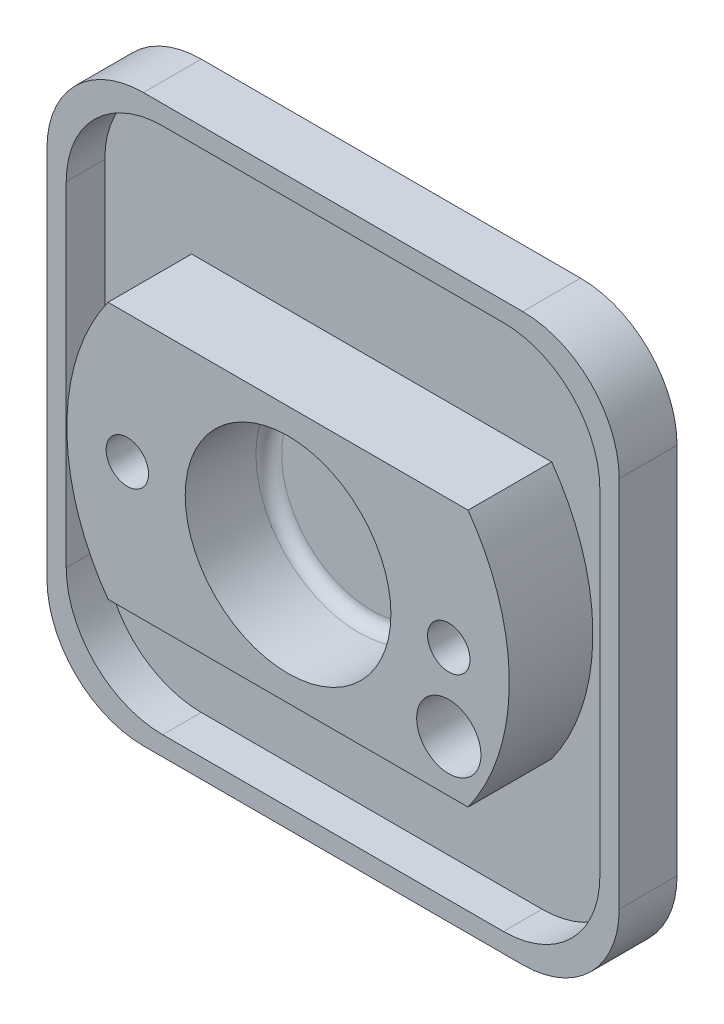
ISO-10303-21;
HEADER;
FILE_DESCRIPTION(('STEP AP214'),'2;1');
FILE_NAME('part.step','',(''),(''),'','','');
FILE_SCHEMA(('AUTOMOTIVE_DESIGN { 1 0 10303 214 1 1 1 1 }'));
ENDSEC;
DATA;
#1=APPLICATION_CONTEXT('core data for automotive mechanical design processes');
#2=APPLICATION_PROTOCOL_DEFINITION('international standard','automotive_design',2000,#1);
#3=PRODUCT_CONTEXT('',#1,'mechanical');
#4=PRODUCT('Part','Part','',(#3));
#5=PRODUCT_RELATED_PRODUCT_CATEGORY('part','',(#4));
#6=PRODUCT_DEFINITION_FORMATION('','',#4);
#7=PRODUCT_DEFINITION_CONTEXT('part definition',#1,'design');
#8=PRODUCT_DEFINITION('design','',#6,#7);
#9=PRODUCT_DEFINITION_SHAPE('','',#8);
#10=(LENGTH_UNIT() NAMED_UNIT(*) SI_UNIT(.MILLI.,.METRE.));
#11=(NAMED_UNIT(*) PLANE_ANGLE_UNIT() SI_UNIT($,.RADIAN.));
#12=(NAMED_UNIT(*) SI_UNIT($,.STERADIAN.) SOLID_ANGLE_UNIT());
#13=UNCERTAINTY_MEASURE_WITH_UNIT(LENGTH_MEASURE(1.E-05),#10,'distance_accuracy_value','');
#14=(GEOMETRIC_REPRESENTATION_CONTEXT(3) GLOBAL_UNCERTAINTY_ASSIGNED_CONTEXT((#13)) GLOBAL_UNIT_ASSIGNED_CONTEXT((#10,
#11,#12)) REPRESENTATION_CONTEXT('',''));
#15=CARTESIAN_POINT('',(0.,0.,0.));
#16=DIRECTION('',(0.,0.,1.));
#17=DIRECTION('',(1.,0.,0.));
#18=AXIS2_PLACEMENT_3D('',#15,#16,#17);
#19=CARTESIAN_POINT('',(-44.5,-44.,3.));
#20=DIRECTION('',(0.,0.,1.));
#21=DIRECTION('',(1.,0.,0.));
#22=AXIS2_PLACEMENT_3D('',#19,#20,#21);
#23=PLANE('',#22);
#24=DIRECTION('',(1.,0.,0.));
#25=VECTOR('',#24,1.);
#26=CARTESIAN_POINT('',(-44.5,-41.,3.));
#27=LINE('',#26,#25);
#28=CARTESIAN_POINT('',(-26.5,-41.,3.));
#29=VERTEX_POINT('',#28);
#30=CARTESIAN_POINT('',(26.5,-41.,3.));
#31=VERTEX_POINT('',#30);
#32=EDGE_CURVE('E201',#29,#31,#27,.T.);
#33=ORIENTED_EDGE('',*,*,#32,.T.);
#34=CARTESIAN_POINT('',(26.5,-26.,3.));
#35=DIRECTION('',(0.,0.,1.));
#36=DIRECTION('',(1.,0.,0.));
#37=AXIS2_PLACEMENT_3D('',#34,#35,#36);
#38=CIRCLE('',#37,15.);
#39=CARTESIAN_POINT('',(41.5,-26.,3.));
#40=VERTEX_POINT('',#39);
#41=EDGE_CURVE('E274',#31,#40,#38,.T.);
#42=ORIENTED_EDGE('',*,*,#41,.T.);
#43=DIRECTION('',(0.,1.,0.));
#44=VECTOR('',#43,1.);
#45=CARTESIAN_POINT('',(41.5,44.,3.));
#46=LINE('',#45,#44);
#47=CARTESIAN_POINT('',(41.5,26.,3.));
#48=VERTEX_POINT('',#47);
#49=EDGE_CURVE('E204',#40,#48,#46,.T.);
#50=ORIENTED_EDGE('',*,*,#49,.T.);
#51=CARTESIAN_POINT('',(26.5,26.,3.));
#52=DIRECTION('',(0.,0.,1.));
#53=DIRECTION('',(1.,0.,0.));
#54=AXIS2_PLACEMENT_3D('',#51,#52,#53);
#55=CIRCLE('',#54,15.);
#56=CARTESIAN_POINT('',(26.5,41.,3.));
#57=VERTEX_POINT('',#56);
#58=EDGE_CURVE('E255',#48,#57,#55,.T.);
#59=ORIENTED_EDGE('',*,*,#58,.T.);
#60=DIRECTION('',(-1.,0.,0.));
#61=VECTOR('',#60,1.);
#62=CARTESIAN_POINT('',(-44.5,41.,3.));
#63=LINE('',#62,#61);
#64=CARTESIAN_POINT('',(-26.5,41.,3.));
#65=VERTEX_POINT('',#64);
#66=EDGE_CURVE('E206',#57,#65,#63,.T.);
#67=ORIENTED_EDGE('',*,*,#66,.T.);
#68=CARTESIAN_POINT('',(-26.5,26.,3.));
#69=DIRECTION('',(0.,0.,1.));
#70=DIRECTION('',(1.,0.,0.));
#71=AXIS2_PLACEMENT_3D('',#68,#69,#70);
#72=CIRCLE('',#71,15.);
#73=CARTESIAN_POINT('',(-41.5,26.,3.));
#74=VERTEX_POINT('',#73);
#75=EDGE_CURVE('E245',#65,#74,#72,.T.);
#76=ORIENTED_EDGE('',*,*,#75,.T.);
#77=DIRECTION('',(0.,-1.,0.));
#78=VECTOR('',#77,1.);
#79=CARTESIAN_POINT('',(-41.5,44.,3.));
#80=LINE('',#79,#78);
#81=CARTESIAN_POINT('',(-41.5,-26.,3.));
#82=VERTEX_POINT('',#81);
#83=EDGE_CURVE('E166',#74,#82,#80,.T.);
#84=ORIENTED_EDGE('',*,*,#83,.T.);
#85=CARTESIAN_POINT('',(-26.5,-26.,3.));
#86=DIRECTION('',(0.,0.,1.));
#87=DIRECTION('',(1.,0.,0.));
#88=AXIS2_PLACEMENT_3D('',#85,#86,#87);
#89=CIRCLE('',#88,15.);
#90=EDGE_CURVE('E265',#82,#29,#89,.T.);
#91=ORIENTED_EDGE('',*,*,#90,.T.);
#92=EDGE_LOOP('',(#33,#42,#50,#59,#67,#76,#84,#91));
#93=FACE_BOUND('',#92,.T.);
#94=DIRECTION('',(-1.,0.,0.));
#95=VECTOR('',#94,1.);
#96=CARTESIAN_POINT('',(-28.,20.,3.));
#97=LINE('',#96,#95);
#98=CARTESIAN_POINT('',(28.,20.,3.));
#99=VERTEX_POINT('',#98);
#100=CARTESIAN_POINT('',(-28.,20.,3.));
#101=VERTEX_POINT('',#100);
#102=EDGE_CURVE('E160',#99,#101,#97,.T.);
#103=ORIENTED_EDGE('',*,*,#102,.F.);
#104=CARTESIAN_POINT('',(0.,0.,3.));
#105=DIRECTION('',(0.,0.,1.));
#106=DIRECTION('',(-1.,0.,0.));
#107=AXIS2_PLACEMENT_3D('',#104,#105,#106);
#108=CIRCLE('',#107,34.4093010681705);
#109=CARTESIAN_POINT('',(28.,-20.,3.));
#110=VERTEX_POINT('',#109);
#111=EDGE_CURVE('E171',#110,#99,#108,.T.);
#112=ORIENTED_EDGE('',*,*,#111,.F.);
#113=DIRECTION('',(1.,0.,0.));
#114=VECTOR('',#113,1.);
#115=CARTESIAN_POINT('',(-28.,-20.,3.));
#116=LINE('',#115,#114);
#117=CARTESIAN_POINT('',(-28.,-20.,3.));
#118=VERTEX_POINT('',#117);
#119=EDGE_CURVE('E183',#118,#110,#116,.T.);
#120=ORIENTED_EDGE('',*,*,#119,.F.);
#121=CARTESIAN_POINT('',(0.,0.,3.));
#122=DIRECTION('',(0.,0.,1.));
#123=DIRECTION('',(1.,0.,0.));
#124=AXIS2_PLACEMENT_3D('',#121,#122,#123);
#125=CIRCLE('',#124,34.4093010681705);
#126=EDGE_CURVE('E181',#101,#118,#125,.T.);
#127=ORIENTED_EDGE('',*,*,#126,.F.);
#128=EDGE_LOOP('',(#103,#112,#120,#127));
#129=FACE_BOUND('',#128,.T.);
#130=ADVANCED_FACE('F17',(#93,#129),#23,.T.);
#131=CARTESIAN_POINT('',(-44.5,44.,9.));
#132=DIRECTION('',(1.,0.,0.));
#133=DIRECTION('',(0.,1.,0.));
#134=AXIS2_PLACEMENT_3D('',#131,#132,#133);
#135=PLANE('',#134);
#136=DIRECTION('',(0.,-1.,0.));
#137=VECTOR('',#136,1.);
#138=CARTESIAN_POINT('',(-44.5,44.,0.));
#139=LINE('',#138,#137);
#140=CARTESIAN_POINT('',(-44.5,29.,0.));
#141=VERTEX_POINT('',#140);
#142=CARTESIAN_POINT('',(-44.5,-29.,0.));
#143=VERTEX_POINT('',#142);
#144=EDGE_CURVE('E218',#141,#143,#139,.T.);
#145=ORIENTED_EDGE('',*,*,#144,.T.);
#146=DIRECTION('',(0.,0.,-1.));
#147=VECTOR('',#146,1.);
#148=CARTESIAN_POINT('',(-44.5,-29.,9.));
#149=LINE('',#148,#147);
#150=CARTESIAN_POINT('',(-44.5,-29.,9.));
#151=VERTEX_POINT('',#150);
#152=EDGE_CURVE('E32',#143,#151,#149,.F.);
#153=ORIENTED_EDGE('',*,*,#152,.T.);
#154=DIRECTION('',(0.,-1.,0.));
#155=VECTOR('',#154,1.);
#156=CARTESIAN_POINT('',(-44.5,44.,9.));
#157=LINE('',#156,#155);
#158=CARTESIAN_POINT('',(-44.5,29.,9.));
#159=VERTEX_POINT('',#158);
#160=EDGE_CURVE('E227',#159,#151,#157,.T.);
#161=ORIENTED_EDGE('',*,*,#160,.F.);
#162=DIRECTION('',(0.,0.,-1.));
#163=VECTOR('',#162,1.);
#164=CARTESIAN_POINT('',(-44.5,29.,9.));
#165=LINE('',#164,#163);
#166=EDGE_CURVE('E302',#159,#141,#165,.T.);
#167=ORIENTED_EDGE('',*,*,#166,.T.);
#168=EDGE_LOOP('',(#145,#153,#161,#167));
#169=FACE_BOUND('',#168,.T.);
#170=ADVANCED_FACE('F19',(#169),#135,.F.);
#171=CARTESIAN_POINT('',(-44.5,-44.,9.));
#172=DIRECTION('',(0.,1.,0.));
#173=DIRECTION('',(0.,0.,1.));
#174=AXIS2_PLACEMENT_3D('',#171,#172,#173);
#175=PLANE('',#174);
#176=DIRECTION('',(1.,0.,0.));
#177=VECTOR('',#176,1.);
#178=CARTESIAN_POINT('',(-44.5,-44.,9.));
#179=LINE('',#178,#177);
#180=CARTESIAN_POINT('',(-29.5,-44.,9.));
#181=VERTEX_POINT('',#180);
#182=CARTESIAN_POINT('',(29.5,-44.,9.));
#183=VERTEX_POINT('',#182);
#184=EDGE_CURVE('E229',#181,#183,#179,.T.);
#185=ORIENTED_EDGE('',*,*,#184,.F.);
#186=DIRECTION('',(0.,0.,-1.));
#187=VECTOR('',#186,1.);
#188=CARTESIAN_POINT('',(-29.5,-44.,9.));
#189=LINE('',#188,#187);
#190=CARTESIAN_POINT('',(-29.5,-44.,0.));
#191=VERTEX_POINT('',#190);
#192=EDGE_CURVE('E311',#181,#191,#189,.T.);
#193=ORIENTED_EDGE('',*,*,#192,.T.);
#194=DIRECTION('',(1.,0.,0.));
#195=VECTOR('',#194,1.);
#196=CARTESIAN_POINT('',(-44.5,-44.,0.));
#197=LINE('',#196,#195);
#198=CARTESIAN_POINT('',(29.5,-44.,0.));
#199=VERTEX_POINT('',#198);
#200=EDGE_CURVE('E220',#191,#199,#197,.T.);
#201=ORIENTED_EDGE('',*,*,#200,.T.);
#202=DIRECTION('',(0.,0.,-1.));
#203=VECTOR('',#202,1.);
#204=CARTESIAN_POINT('',(29.5,-44.,9.));
#205=LINE('',#204,#203);
#206=EDGE_CURVE('E297',#199,#183,#205,.F.);
#207=ORIENTED_EDGE('',*,*,#206,.T.);
#208=EDGE_LOOP('',(#185,#193,#201,#207));
#209=FACE_BOUND('',#208,.T.);
#210=ADVANCED_FACE('F369',(#209),#175,.F.);
#211=CARTESIAN_POINT('',(44.5,44.,9.));
#212=DIRECTION('',(-1.,0.,0.));
#213=DIRECTION('',(0.,-1.,0.));
#214=AXIS2_PLACEMENT_3D('',#211,#212,#213);
#215=PLANE('',#214);
#216=DIRECTION('',(0.,1.,0.));
#217=VECTOR('',#216,1.);
#218=CARTESIAN_POINT('',(44.5,44.,9.));
#219=LINE('',#218,#217);
#220=CARTESIAN_POINT('',(44.5,-29.,9.));
#221=VERTEX_POINT('',#220);
#222=CARTESIAN_POINT('',(44.5,29.,9.));
#223=VERTEX_POINT('',#222);
#224=EDGE_CURVE('E231',#221,#223,#219,.T.);
#225=ORIENTED_EDGE('',*,*,#224,.F.);
#226=DIRECTION('',(0.,0.,-1.));
#227=VECTOR('',#226,1.);
#228=CARTESIAN_POINT('',(44.5,-29.,9.));
#229=LINE('',#228,#227);
#230=CARTESIAN_POINT('',(44.5,-29.,0.));
#231=VERTEX_POINT('',#230);
#232=EDGE_CURVE('E291',#221,#231,#229,.T.);
#233=ORIENTED_EDGE('',*,*,#232,.T.);
#234=DIRECTION('',(0.,1.,0.));
#235=VECTOR('',#234,1.);
#236=CARTESIAN_POINT('',(44.5,44.,0.));
#237=LINE('',#236,#235);
#238=CARTESIAN_POINT('',(44.5,29.,0.));
#239=VERTEX_POINT('',#238);
#240=EDGE_CURVE('E222',#231,#239,#237,.T.);
#241=ORIENTED_EDGE('',*,*,#240,.T.);
#242=DIRECTION('',(0.,0.,-1.));
#243=VECTOR('',#242,1.);
#244=CARTESIAN_POINT('',(44.5,29.,9.));
#245=LINE('',#244,#243);
#246=EDGE_CURVE('E286',#239,#223,#245,.F.);
#247=ORIENTED_EDGE('',*,*,#246,.T.);
#248=EDGE_LOOP('',(#225,#233,#241,#247));
#249=FACE_BOUND('',#248,.T.);
#250=ADVANCED_FACE('F391',(#249),#215,.F.);
#251=CARTESIAN_POINT('',(-44.5,44.,9.));
#252=DIRECTION('',(0.,-1.,0.));
#253=DIRECTION('',(0.,0.,-1.));
#254=AXIS2_PLACEMENT_3D('',#251,#252,#253);
#255=PLANE('',#254);
#256=DIRECTION('',(-1.,0.,0.));
#257=VECTOR('',#256,1.);
#258=CARTESIAN_POINT('',(-44.5,44.,0.));
#259=LINE('',#258,#257);
#260=CARTESIAN_POINT('',(29.5,44.,0.));
#261=VERTEX_POINT('',#260);
#262=CARTESIAN_POINT('',(-29.5,44.,0.));
#263=VERTEX_POINT('',#262);
#264=EDGE_CURVE('E224',#261,#263,#259,.T.);
#265=ORIENTED_EDGE('',*,*,#264,.T.);
#266=DIRECTION('',(0.,0.,-1.));
#267=VECTOR('',#266,1.);
#268=CARTESIAN_POINT('',(-29.5,44.,9.));
#269=LINE('',#268,#267);
#270=CARTESIAN_POINT('',(-29.5,44.,9.));
#271=VERTEX_POINT('',#270);
#272=EDGE_CURVE('E307',#263,#271,#269,.F.);
#273=ORIENTED_EDGE('',*,*,#272,.T.);
#274=DIRECTION('',(-1.,0.,0.));
#275=VECTOR('',#274,1.);
#276=CARTESIAN_POINT('',(-44.5,44.,9.));
#277=LINE('',#276,#275);
#278=CARTESIAN_POINT('',(29.5,44.,9.));
#279=VERTEX_POINT('',#278);
#280=EDGE_CURVE('E233',#279,#271,#277,.T.);
#281=ORIENTED_EDGE('',*,*,#280,.F.);
#282=DIRECTION('',(0.,0.,-1.));
#283=VECTOR('',#282,1.);
#284=CARTESIAN_POINT('',(29.5,44.,9.));
#285=LINE('',#284,#283);
#286=EDGE_CURVE('E280',#279,#261,#285,.T.);
#287=ORIENTED_EDGE('',*,*,#286,.T.);
#288=EDGE_LOOP('',(#265,#273,#281,#287));
#289=FACE_BOUND('',#288,.T.);
#290=ADVANCED_FACE('F382',(#289),#255,.F.);
#291=CARTESIAN_POINT('',(-44.5,-44.,9.));
#292=DIRECTION('',(0.,0.,1.));
#293=DIRECTION('',(1.,0.,0.));
#294=AXIS2_PLACEMENT_3D('',#291,#292,#293);
#295=PLANE('',#294);
#296=DIRECTION('',(0.,-1.,0.));
#297=VECTOR('',#296,1.);
#298=CARTESIAN_POINT('',(-41.5,44.,9.));
#299=LINE('',#298,#297);
#300=CARTESIAN_POINT('',(-41.5,26.,9.));
#301=VERTEX_POINT('',#300);
#302=CARTESIAN_POINT('',(-41.5,-26.,9.));
#303=VERTEX_POINT('',#302);
#304=EDGE_CURVE('E208',#301,#303,#299,.T.);
#305=ORIENTED_EDGE('',*,*,#304,.F.);
#306=CARTESIAN_POINT('',(-26.5,26.,9.));
#307=DIRECTION('',(0.,0.,1.));
#308=DIRECTION('',(1.,0.,0.));
#309=AXIS2_PLACEMENT_3D('',#306,#307,#308);
#310=CIRCLE('',#309,15.);
#311=CARTESIAN_POINT('',(-26.5,41.,9.));
#312=VERTEX_POINT('',#311);
#313=EDGE_CURVE('E249',#301,#312,#310,.F.);
#314=ORIENTED_EDGE('',*,*,#313,.T.);
#315=DIRECTION('',(-1.,0.,0.));
#316=VECTOR('',#315,1.);
#317=CARTESIAN_POINT('',(-44.5,41.,9.));
#318=LINE('',#317,#316);
#319=CARTESIAN_POINT('',(26.5,41.,9.));
#320=VERTEX_POINT('',#319);
#321=EDGE_CURVE('E216',#320,#312,#318,.T.);
#322=ORIENTED_EDGE('',*,*,#321,.F.);
#323=CARTESIAN_POINT('',(26.5,26.,9.));
#324=DIRECTION('',(0.,0.,1.));
#325=DIRECTION('',(1.,0.,0.));
#326=AXIS2_PLACEMENT_3D('',#323,#324,#325);
#327=CIRCLE('',#326,15.);
#328=CARTESIAN_POINT('',(41.5,26.,9.));
#329=VERTEX_POINT('',#328);
#330=EDGE_CURVE('E259',#320,#329,#327,.F.);
#331=ORIENTED_EDGE('',*,*,#330,.T.);
#332=DIRECTION('',(0.,1.,0.));
#333=VECTOR('',#332,1.);
#334=CARTESIAN_POINT('',(41.5,44.,9.));
#335=LINE('',#334,#333);
#336=CARTESIAN_POINT('',(41.5,-26.,9.));
#337=VERTEX_POINT('',#336);
#338=EDGE_CURVE('E214',#337,#329,#335,.T.);
#339=ORIENTED_EDGE('',*,*,#338,.F.);
#340=CARTESIAN_POINT('',(26.5,-26.,9.));
#341=DIRECTION('',(0.,0.,1.));
#342=DIRECTION('',(1.,0.,0.));
#343=AXIS2_PLACEMENT_3D('',#340,#341,#342);
#344=CIRCLE('',#343,15.);
#345=CARTESIAN_POINT('',(26.5,-41.,9.));
#346=VERTEX_POINT('',#345);
#347=EDGE_CURVE('E278',#337,#346,#344,.F.);
#348=ORIENTED_EDGE('',*,*,#347,.T.);
#349=DIRECTION('',(1.,0.,0.));
#350=VECTOR('',#349,1.);
#351=CARTESIAN_POINT('',(-44.5,-41.,9.));
#352=LINE('',#351,#350);
#353=CARTESIAN_POINT('',(-26.5,-41.,9.));
#354=VERTEX_POINT('',#353);
#355=EDGE_CURVE('E211',#354,#346,#352,.T.);
#356=ORIENTED_EDGE('',*,*,#355,.F.);
#357=CARTESIAN_POINT('',(-26.5,-26.,9.));
#358=DIRECTION('',(0.,0.,1.));
#359=DIRECTION('',(1.,0.,0.));
#360=AXIS2_PLACEMENT_3D('',#357,#358,#359);
#361=CIRCLE('',#360,15.);
#362=EDGE_CURVE('E269',#354,#303,#361,.F.);
#363=ORIENTED_EDGE('',*,*,#362,.T.);
#364=EDGE_LOOP('',(#305,#314,#322,#331,#339,#348,#356,#363));
#365=FACE_BOUND('',#364,.T.);
#366=ORIENTED_EDGE('',*,*,#160,.T.);
#367=CARTESIAN_POINT('',(-29.5,-29.,9.));
#368=DIRECTION('',(0.,0.,1.));
#369=DIRECTION('',(1.,0.,0.));
#370=AXIS2_PLACEMENT_3D('',#367,#368,#369);
#371=CIRCLE('',#370,15.);
#372=EDGE_CURVE('E316',#151,#181,#371,.T.);
#373=ORIENTED_EDGE('',*,*,#372,.T.);
#374=ORIENTED_EDGE('',*,*,#184,.T.);
#375=CARTESIAN_POINT('',(29.5,-29.,9.));
#376=DIRECTION('',(0.,0.,1.));
#377=DIRECTION('',(1.,0.,0.));
#378=AXIS2_PLACEMENT_3D('',#375,#376,#377);
#379=CIRCLE('',#378,15.);
#380=EDGE_CURVE('E300',#183,#221,#379,.T.);
#381=ORIENTED_EDGE('',*,*,#380,.T.);
#382=ORIENTED_EDGE('',*,*,#224,.T.);
#383=CARTESIAN_POINT('',(29.5,29.,9.));
#384=DIRECTION('',(0.,0.,1.));
#385=DIRECTION('',(1.,0.,0.));
#386=AXIS2_PLACEMENT_3D('',#383,#384,#385);
#387=CIRCLE('',#386,15.);
#388=EDGE_CURVE('E289',#223,#279,#387,.T.);
#389=ORIENTED_EDGE('',*,*,#388,.T.);
#390=ORIENTED_EDGE('',*,*,#280,.T.);
#391=CARTESIAN_POINT('',(-29.5,29.,9.));
#392=DIRECTION('',(0.,0.,1.));
#393=DIRECTION('',(1.,0.,0.));
#394=AXIS2_PLACEMENT_3D('',#391,#392,#393);
#395=CIRCLE('',#394,15.);
#396=EDGE_CURVE('E309',#271,#159,#395,.T.);
#397=ORIENTED_EDGE('',*,*,#396,.T.);
#398=EDGE_LOOP('',(#366,#373,#374,#381,#382,#389,#390,#397));
#399=FACE_BOUND('',#398,.T.);
#400=ADVANCED_FACE('F363',(#365,#399),#295,.T.);
#401=CARTESIAN_POINT('',(-44.5,-44.,0.));
#402=DIRECTION('',(0.,0.,1.));
#403=DIRECTION('',(1.,0.,0.));
#404=AXIS2_PLACEMENT_3D('',#401,#402,#403);
#405=PLANE('',#404);
#406=CARTESIAN_POINT('',(25.,0.,0.));
#407=DIRECTION('',(0.,0.,1.));
#408=DIRECTION('',(1.,0.,0.));
#409=AXIS2_PLACEMENT_3D('',#406,#407,#408);
#410=CIRCLE('',#409,6.3);
#411=CARTESIAN_POINT('',(31.3,0.,0.));
#412=VERTEX_POINT('',#411);
#413=EDGE_CURVE('E25',#412,#412,#410,.T.);
#414=ORIENTED_EDGE('',*,*,#413,.T.);
#415=EDGE_LOOP('',(#414));
#416=FACE_BOUND('',#415,.T.);
#417=CARTESIAN_POINT('',(-25.,0.,0.));
#418=DIRECTION('',(0.,0.,1.));
#419=DIRECTION('',(1.,0.,0.));
#420=AXIS2_PLACEMENT_3D('',#417,#418,#419);
#421=CIRCLE('',#420,6.3);
#422=CARTESIAN_POINT('',(-18.7,0.,0.));
#423=VERTEX_POINT('',#422);
#424=EDGE_CURVE('E321',#423,#423,#421,.T.);
#425=ORIENTED_EDGE('',*,*,#424,.T.);
#426=EDGE_LOOP('',(#425));
#427=FACE_BOUND('',#426,.T.);
#428=CARTESIAN_POINT('',(25.,-12.,0.));
#429=DIRECTION('',(0.,0.,-1.));
#430=DIRECTION('',(-1.,0.,0.));
#431=AXIS2_PLACEMENT_3D('',#428,#429,#430);
#432=CIRCLE('',#431,5.);
#433=CARTESIAN_POINT('',(20.,-12.,0.));
#434=VERTEX_POINT('',#433);
#435=EDGE_CURVE('E356',#434,#434,#432,.T.);
#436=ORIENTED_EDGE('',*,*,#435,.F.);
#437=EDGE_LOOP('',(#436));
#438=FACE_BOUND('',#437,.T.);
#439=ORIENTED_EDGE('',*,*,#200,.F.);
#440=CARTESIAN_POINT('',(-29.5,-29.,0.));
#441=DIRECTION('',(0.,0.,1.));
#442=DIRECTION('',(1.,0.,0.));
#443=AXIS2_PLACEMENT_3D('',#440,#441,#442);
#444=CIRCLE('',#443,15.);
#445=EDGE_CURVE('E40',#191,#143,#444,.F.);
#446=ORIENTED_EDGE('',*,*,#445,.T.);
#447=ORIENTED_EDGE('',*,*,#144,.F.);
#448=CARTESIAN_POINT('',(-29.5,29.,0.));
#449=DIRECTION('',(0.,0.,1.));
#450=DIRECTION('',(1.,0.,0.));
#451=AXIS2_PLACEMENT_3D('',#448,#449,#450);
#452=CIRCLE('',#451,15.);
#453=EDGE_CURVE('E305',#141,#263,#452,.F.);
#454=ORIENTED_EDGE('',*,*,#453,.T.);
#455=ORIENTED_EDGE('',*,*,#264,.F.);
#456=CARTESIAN_POINT('',(29.5,29.,0.));
#457=DIRECTION('',(0.,0.,1.));
#458=DIRECTION('',(1.,0.,0.));
#459=AXIS2_PLACEMENT_3D('',#456,#457,#458);
#460=CIRCLE('',#459,15.);
#461=EDGE_CURVE('E283',#261,#239,#460,.F.);
#462=ORIENTED_EDGE('',*,*,#461,.T.);
#463=ORIENTED_EDGE('',*,*,#240,.F.);
#464=CARTESIAN_POINT('',(29.5,-29.,0.));
#465=DIRECTION('',(0.,0.,1.));
#466=DIRECTION('',(1.,0.,0.));
#467=AXIS2_PLACEMENT_3D('',#464,#465,#466);
#468=CIRCLE('',#467,15.);
#469=EDGE_CURVE('E294',#231,#199,#468,.F.);
#470=ORIENTED_EDGE('',*,*,#469,.T.);
#471=EDGE_LOOP('',(#439,#446,#447,#454,#455,#462,#463,#470));
#472=FACE_BOUND('',#471,.T.);
#473=ADVANCED_FACE('F326',(#416,#427,#438,#472),#405,.F.);
#474=CARTESIAN_POINT('',(-41.5,44.,9.));
#475=DIRECTION('',(1.,0.,0.));
#476=DIRECTION('',(0.,1.,0.));
#477=AXIS2_PLACEMENT_3D('',#474,#475,#476);
#478=PLANE('',#477);
#479=ORIENTED_EDGE('',*,*,#304,.T.);
#480=DIRECTION('',(0.,0.,-1.));
#481=VECTOR('',#480,1.);
#482=CARTESIAN_POINT('',(-41.5,-26.,3.));
#483=LINE('',#482,#481);
#484=EDGE_CURVE('E262',#303,#82,#483,.T.);
#485=ORIENTED_EDGE('',*,*,#484,.T.);
#486=ORIENTED_EDGE('',*,*,#83,.F.);
#487=DIRECTION('',(0.,0.,-1.));
#488=VECTOR('',#487,1.);
#489=CARTESIAN_POINT('',(-41.5,26.,9.));
#490=LINE('',#489,#488);
#491=EDGE_CURVE('E247',#74,#301,#490,.F.);
#492=ORIENTED_EDGE('',*,*,#491,.T.);
#493=EDGE_LOOP('',(#479,#485,#486,#492));
#494=FACE_BOUND('',#493,.T.);
#495=ADVANCED_FACE('F362',(#494),#478,.T.);
#496=CARTESIAN_POINT('',(-44.5,-41.,9.));
#497=DIRECTION('',(0.,1.,0.));
#498=DIRECTION('',(0.,0.,1.));
#499=AXIS2_PLACEMENT_3D('',#496,#497,#498);
#500=PLANE('',#499);
#501=ORIENTED_EDGE('',*,*,#355,.T.);
#502=DIRECTION('',(0.,0.,-1.));
#503=VECTOR('',#502,1.);
#504=CARTESIAN_POINT('',(26.5,-41.,3.));
#505=LINE('',#504,#503);
#506=EDGE_CURVE('E271',#346,#31,#505,.T.);
#507=ORIENTED_EDGE('',*,*,#506,.T.);
#508=ORIENTED_EDGE('',*,*,#32,.F.);
#509=DIRECTION('',(0.,0.,-1.));
#510=VECTOR('',#509,1.);
#511=CARTESIAN_POINT('',(-26.5,-41.,9.));
#512=LINE('',#511,#510);
#513=EDGE_CURVE('E267',#29,#354,#512,.F.);
#514=ORIENTED_EDGE('',*,*,#513,.T.);
#515=EDGE_LOOP('',(#501,#507,#508,#514));
#516=FACE_BOUND('',#515,.T.);
#517=ADVANCED_FACE('F458',(#516),#500,.T.);
#518=CARTESIAN_POINT('',(41.5,44.,9.));
#519=DIRECTION('',(-1.,0.,0.));
#520=DIRECTION('',(0.,-1.,0.));
#521=AXIS2_PLACEMENT_3D('',#518,#519,#520);
#522=PLANE('',#521);
#523=ORIENTED_EDGE('',*,*,#49,.F.);
#524=DIRECTION('',(0.,0.,-1.));
#525=VECTOR('',#524,1.);
#526=CARTESIAN_POINT('',(41.5,-26.,9.));
#527=LINE('',#526,#525);
#528=EDGE_CURVE('E276',#40,#337,#527,.F.);
#529=ORIENTED_EDGE('',*,*,#528,.T.);
#530=ORIENTED_EDGE('',*,*,#338,.T.);
#531=DIRECTION('',(0.,0.,-1.));
#532=VECTOR('',#531,1.);
#533=CARTESIAN_POINT('',(41.5,26.,3.));
#534=LINE('',#533,#532);
#535=EDGE_CURVE('E252',#329,#48,#534,.T.);
#536=ORIENTED_EDGE('',*,*,#535,.T.);
#537=EDGE_LOOP('',(#523,#529,#530,#536));
#538=FACE_BOUND('',#537,.T.);
#539=ADVANCED_FACE('F443',(#538),#522,.T.);
#540=CARTESIAN_POINT('',(-44.5,41.,9.));
#541=DIRECTION('',(0.,-1.,0.));
#542=DIRECTION('',(0.,0.,-1.));
#543=AXIS2_PLACEMENT_3D('',#540,#541,#542);
#544=PLANE('',#543);
#545=ORIENTED_EDGE('',*,*,#66,.F.);
#546=DIRECTION('',(0.,0.,-1.));
#547=VECTOR('',#546,1.);
#548=CARTESIAN_POINT('',(26.5,41.,9.));
#549=LINE('',#548,#547);
#550=EDGE_CURVE('E257',#57,#320,#549,.F.);
#551=ORIENTED_EDGE('',*,*,#550,.T.);
#552=ORIENTED_EDGE('',*,*,#321,.T.);
#553=DIRECTION('',(0.,0.,-1.));
#554=VECTOR('',#553,1.);
#555=CARTESIAN_POINT('',(-26.5,41.,3.));
#556=LINE('',#555,#554);
#557=EDGE_CURVE('E242',#312,#65,#556,.T.);
#558=ORIENTED_EDGE('',*,*,#557,.T.);
#559=EDGE_LOOP('',(#545,#551,#552,#558));
#560=FACE_BOUND('',#559,.T.);
#561=ADVANCED_FACE('F435',(#560),#544,.T.);
#562=CARTESIAN_POINT('',(0.,0.,16.));
#563=DIRECTION('',(0.,0.,-1.));
#564=DIRECTION('',(-1.,0.,0.));
#565=AXIS2_PLACEMENT_3D('',#562,#563,#564);
#566=PLANE('',#565);
#567=CARTESIAN_POINT('',(25.,-12.,16.));
#568=DIRECTION('',(0.,0.,-1.));
#569=DIRECTION('',(-1.,0.,0.));
#570=AXIS2_PLACEMENT_3D('',#567,#568,#569);
#571=CIRCLE('',#570,5.);
#572=CARTESIAN_POINT('',(20.,-12.,16.));
#573=VERTEX_POINT('',#572);
#574=EDGE_CURVE('E351',#573,#573,#571,.T.);
#575=ORIENTED_EDGE('',*,*,#574,.T.);
#576=EDGE_LOOP('',(#575));
#577=FACE_BOUND('',#576,.T.);
#578=CARTESIAN_POINT('',(-25.,0.,16.));
#579=DIRECTION('',(0.,0.,-1.));
#580=DIRECTION('',(1.,0.,0.));
#581=AXIS2_PLACEMENT_3D('',#578,#579,#580);
#582=CIRCLE('',#581,3.3);
#583=CARTESIAN_POINT('',(-21.7,0.,16.));
#584=VERTEX_POINT('',#583);
#585=EDGE_CURVE('E347',#584,#584,#582,.T.);
#586=ORIENTED_EDGE('',*,*,#585,.T.);
#587=EDGE_LOOP('',(#586));
#588=FACE_BOUND('',#587,.T.);
#589=CARTESIAN_POINT('',(25.,0.,16.));
#590=DIRECTION('',(0.,0.,-1.));
#591=DIRECTION('',(-1.,0.,0.));
#592=AXIS2_PLACEMENT_3D('',#589,#590,#591);
#593=CIRCLE('',#592,3.3);
#594=CARTESIAN_POINT('',(21.7,0.,16.));
#595=VERTEX_POINT('',#594);
#596=EDGE_CURVE('E345',#595,#595,#593,.T.);
#597=ORIENTED_EDGE('',*,*,#596,.T.);
#598=EDGE_LOOP('',(#597));
#599=FACE_BOUND('',#598,.T.);
#600=CARTESIAN_POINT('',(0.,0.,16.));
#601=DIRECTION('',(0.,0.,1.));
#602=DIRECTION('',(-1.,0.,0.));
#603=AXIS2_PLACEMENT_3D('',#600,#601,#602);
#604=CIRCLE('',#603,34.4093010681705);
#605=CARTESIAN_POINT('',(28.,-20.,16.));
#606=VERTEX_POINT('',#605);
#607=CARTESIAN_POINT('',(28.,20.,16.));
#608=VERTEX_POINT('',#607);
#609=EDGE_CURVE('E188',#606,#608,#604,.T.);
#610=ORIENTED_EDGE('',*,*,#609,.T.);
#611=DIRECTION('',(-1.,0.,0.));
#612=VECTOR('',#611,1.);
#613=CARTESIAN_POINT('',(-28.,20.,16.));
#614=LINE('',#613,#612);
#615=CARTESIAN_POINT('',(-28.,20.,16.));
#616=VERTEX_POINT('',#615);
#617=EDGE_CURVE('E162',#608,#616,#614,.T.);
#618=ORIENTED_EDGE('',*,*,#617,.T.);
#619=CARTESIAN_POINT('',(0.,0.,16.));
#620=DIRECTION('',(0.,0.,1.));
#621=DIRECTION('',(1.,0.,0.));
#622=AXIS2_PLACEMENT_3D('',#619,#620,#621);
#623=CIRCLE('',#622,34.4093010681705);
#624=CARTESIAN_POINT('',(-28.,-20.,16.));
#625=VERTEX_POINT('',#624);
#626=EDGE_CURVE('E191',#616,#625,#623,.T.);
#627=ORIENTED_EDGE('',*,*,#626,.T.);
#628=DIRECTION('',(1.,0.,0.));
#629=VECTOR('',#628,1.);
#630=CARTESIAN_POINT('',(-28.,-20.,16.));
#631=LINE('',#630,#629);
#632=EDGE_CURVE('E193',#625,#606,#631,.T.);
#633=ORIENTED_EDGE('',*,*,#632,.T.);
#634=EDGE_LOOP('',(#610,#618,#627,#633));
#635=FACE_BOUND('',#634,.T.);
#636=CARTESIAN_POINT('',(0.,0.,16.));
#637=DIRECTION('',(0.,0.,1.));
#638=DIRECTION('',(1.,0.,0.));
#639=AXIS2_PLACEMENT_3D('',#636,#637,#638);
#640=CIRCLE('',#639,16.);
#641=CARTESIAN_POINT('',(16.,0.,16.));
#642=VERTEX_POINT('',#641);
#643=EDGE_CURVE('E177',#642,#642,#640,.T.);
#644=ORIENTED_EDGE('',*,*,#643,.F.);
#645=EDGE_LOOP('',(#644));
#646=FACE_BOUND('',#645,.T.);
#647=ADVANCED_FACE('F433',(#577,#588,#599,#635,#646),#566,.F.);
#648=CARTESIAN_POINT('',(0.,0.,16.));
#649=DIRECTION('',(0.,0.,-1.));
#650=DIRECTION('',(-1.,0.,0.));
#651=AXIS2_PLACEMENT_3D('',#648,#649,#650);
#652=CYLINDRICAL_SURFACE('',#651,34.4093010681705);
#653=ORIENTED_EDGE('',*,*,#111,.T.);
#654=DIRECTION('',(0.,0.,-1.));
#655=VECTOR('',#654,1.);
#656=CARTESIAN_POINT('',(28.,20.,16.));
#657=LINE('',#656,#655);
#658=EDGE_CURVE('E155',#608,#99,#657,.T.);
#659=ORIENTED_EDGE('',*,*,#658,.F.);
#660=ORIENTED_EDGE('',*,*,#609,.F.);
#661=DIRECTION('',(0.,0.,-1.));
#662=VECTOR('',#661,1.);
#663=CARTESIAN_POINT('',(28.,-20.,16.));
#664=LINE('',#663,#662);
#665=EDGE_CURVE('E174',#606,#110,#664,.T.);
#666=ORIENTED_EDGE('',*,*,#665,.T.);
#667=EDGE_LOOP('',(#653,#659,#660,#666));
#668=FACE_BOUND('',#667,.T.);
#669=ADVANCED_FACE('F172',(#668),#652,.T.);
#670=CARTESIAN_POINT('',(-28.,20.,16.));
#671=DIRECTION('',(0.,-1.,0.));
#672=DIRECTION('',(1.,0.,0.));
#673=AXIS2_PLACEMENT_3D('',#670,#671,#672);
#674=PLANE('',#673);
#675=ORIENTED_EDGE('',*,*,#102,.T.);
#676=DIRECTION('',(0.,0.,-1.));
#677=VECTOR('',#676,1.);
#678=CARTESIAN_POINT('',(-28.,20.,16.));
#679=LINE('',#678,#677);
#680=EDGE_CURVE('E167',#616,#101,#679,.T.);
#681=ORIENTED_EDGE('',*,*,#680,.F.);
#682=ORIENTED_EDGE('',*,*,#617,.F.);
#683=ORIENTED_EDGE('',*,*,#658,.T.);
#684=EDGE_LOOP('',(#675,#681,#682,#683));
#685=FACE_BOUND('',#684,.T.);
#686=ADVANCED_FACE('F157',(#685),#674,.F.);
#687=CARTESIAN_POINT('',(0.,0.,16.));
#688=DIRECTION('',(0.,0.,-1.));
#689=DIRECTION('',(-1.,0.,0.));
#690=AXIS2_PLACEMENT_3D('',#687,#688,#689);
#691=CYLINDRICAL_SURFACE('',#690,34.4093010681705);
#692=ORIENTED_EDGE('',*,*,#126,.T.);
#693=DIRECTION('',(0.,0.,-1.));
#694=VECTOR('',#693,1.);
#695=CARTESIAN_POINT('',(-28.,-20.,16.));
#696=LINE('',#695,#694);
#697=EDGE_CURVE('E196',#625,#118,#696,.T.);
#698=ORIENTED_EDGE('',*,*,#697,.F.);
#699=ORIENTED_EDGE('',*,*,#626,.F.);
#700=ORIENTED_EDGE('',*,*,#680,.T.);
#701=EDGE_LOOP('',(#692,#698,#699,#700));
#702=FACE_BOUND('',#701,.T.);
#703=ADVANCED_FACE('F449',(#702),#691,.T.);
#704=CARTESIAN_POINT('',(-28.,-20.,16.));
#705=DIRECTION('',(0.,1.,0.));
#706=DIRECTION('',(-1.,0.,0.));
#707=AXIS2_PLACEMENT_3D('',#704,#705,#706);
#708=PLANE('',#707);
#709=ORIENTED_EDGE('',*,*,#119,.T.);
#710=ORIENTED_EDGE('',*,*,#665,.F.);
#711=ORIENTED_EDGE('',*,*,#632,.F.);
#712=ORIENTED_EDGE('',*,*,#697,.T.);
#713=EDGE_LOOP('',(#709,#710,#711,#712));
#714=FACE_BOUND('',#713,.T.);
#715=ADVANCED_FACE('F424',(#714),#708,.F.);
#716=CARTESIAN_POINT('',(0.,0.,16.));
#717=DIRECTION('',(0.,0.,-1.));
#718=DIRECTION('',(-1.,0.,0.));
#719=AXIS2_PLACEMENT_3D('',#716,#717,#718);
#720=CYLINDRICAL_SURFACE('',#719,16.);
#721=CARTESIAN_POINT('',(0.,0.,5.));
#722=DIRECTION('',(0.,0.,1.));
#723=DIRECTION('',(1.,0.,0.));
#724=AXIS2_PLACEMENT_3D('',#721,#722,#723);
#725=CIRCLE('',#724,16.);
#726=CARTESIAN_POINT('',(16.,0.,5.));
#727=VERTEX_POINT('',#726);
#728=EDGE_CURVE('E236',#727,#727,#725,.F.);
#729=ORIENTED_EDGE('',*,*,#728,.T.);
#730=EDGE_LOOP('',(#729));
#731=FACE_BOUND('',#730,.T.);
#732=ORIENTED_EDGE('',*,*,#643,.T.);
#733=EDGE_LOOP('',(#732));
#734=FACE_BOUND('',#733,.T.);
#735=ADVANCED_FACE('F415',(#731,#734),#720,.F.);
#736=CARTESIAN_POINT('',(0.,0.,3.));
#737=DIRECTION('',(0.,0.,1.));
#738=DIRECTION('',(1.,0.,0.));
#739=AXIS2_PLACEMENT_3D('',#736,#737,#738);
#740=CIRCLE('',#739,14.);
#741=CARTESIAN_POINT('',(14.,0.,3.));
#742=VERTEX_POINT('',#741);
#743=EDGE_CURVE('E239',#742,#742,#740,.T.);
#744=ORIENTED_EDGE('',*,*,#743,.T.);
#745=EDGE_LOOP('',(#744));
#746=FACE_BOUND('',#745,.T.);
#747=ADVANCED_FACE('F408',(#746),#23,.T.);
#748=CARTESIAN_POINT('',(0.,0.,5.));
#749=DIRECTION('',(0.,0.,1.));
#750=DIRECTION('',(1.,0.,0.));
#751=AXIS2_PLACEMENT_3D('',#748,#749,#750);
#752=TOROIDAL_SURFACE('',#751,14.,2.);
#753=ORIENTED_EDGE('',*,*,#743,.F.);
#754=EDGE_LOOP('',(#753));
#755=FACE_BOUND('',#754,.T.);
#756=ORIENTED_EDGE('',*,*,#728,.F.);
#757=EDGE_LOOP('',(#756));
#758=FACE_BOUND('',#757,.T.);
#759=ADVANCED_FACE('F414',(#755,#758),#752,.F.);
#760=CARTESIAN_POINT('',(-26.5,26.,9.));
#761=DIRECTION('',(0.,0.,1.));
#762=DIRECTION('',(1.,0.,0.));
#763=AXIS2_PLACEMENT_3D('',#760,#761,#762);
#764=CYLINDRICAL_SURFACE('',#763,15.);
#765=ORIENTED_EDGE('',*,*,#313,.F.);
#766=ORIENTED_EDGE('',*,*,#491,.F.);
#767=ORIENTED_EDGE('',*,*,#75,.F.);
#768=ORIENTED_EDGE('',*,*,#557,.F.);
#769=EDGE_LOOP('',(#765,#766,#767,#768));
#770=FACE_BOUND('',#769,.T.);
#771=ADVANCED_FACE('F420',(#770),#764,.F.);
#772=CARTESIAN_POINT('',(26.5,26.,9.));
#773=DIRECTION('',(0.,0.,1.));
#774=DIRECTION('',(1.,0.,0.));
#775=AXIS2_PLACEMENT_3D('',#772,#773,#774);
#776=CYLINDRICAL_SURFACE('',#775,15.);
#777=ORIENTED_EDGE('',*,*,#330,.F.);
#778=ORIENTED_EDGE('',*,*,#550,.F.);
#779=ORIENTED_EDGE('',*,*,#58,.F.);
#780=ORIENTED_EDGE('',*,*,#535,.F.);
#781=EDGE_LOOP('',(#777,#778,#779,#780));
#782=FACE_BOUND('',#781,.T.);
#783=ADVANCED_FACE('F495',(#782),#776,.F.);
#784=CARTESIAN_POINT('',(-26.5,-26.,9.));
#785=DIRECTION('',(0.,0.,1.));
#786=DIRECTION('',(1.,0.,0.));
#787=AXIS2_PLACEMENT_3D('',#784,#785,#786);
#788=CYLINDRICAL_SURFACE('',#787,15.);
#789=ORIENTED_EDGE('',*,*,#362,.F.);
#790=ORIENTED_EDGE('',*,*,#513,.F.);
#791=ORIENTED_EDGE('',*,*,#90,.F.);
#792=ORIENTED_EDGE('',*,*,#484,.F.);
#793=EDGE_LOOP('',(#789,#790,#791,#792));
#794=FACE_BOUND('',#793,.T.);
#795=ADVANCED_FACE('F483',(#794),#788,.F.);
#796=CARTESIAN_POINT('',(26.5,-26.,9.));
#797=DIRECTION('',(0.,0.,1.));
#798=DIRECTION('',(1.,0.,0.));
#799=AXIS2_PLACEMENT_3D('',#796,#797,#798);
#800=CYLINDRICAL_SURFACE('',#799,15.);
#801=ORIENTED_EDGE('',*,*,#347,.F.);
#802=ORIENTED_EDGE('',*,*,#528,.F.);
#803=ORIENTED_EDGE('',*,*,#41,.F.);
#804=ORIENTED_EDGE('',*,*,#506,.F.);
#805=EDGE_LOOP('',(#801,#802,#803,#804));
#806=FACE_BOUND('',#805,.T.);
#807=ADVANCED_FACE('F403',(#806),#800,.F.);
#808=CARTESIAN_POINT('',(29.5,29.,9.));
#809=DIRECTION('',(0.,0.,-1.));
#810=DIRECTION('',(-1.,0.,0.));
#811=AXIS2_PLACEMENT_3D('',#808,#809,#810);
#812=CYLINDRICAL_SURFACE('',#811,15.);
#813=ORIENTED_EDGE('',*,*,#388,.F.);
#814=ORIENTED_EDGE('',*,*,#246,.F.);
#815=ORIENTED_EDGE('',*,*,#461,.F.);
#816=ORIENTED_EDGE('',*,*,#286,.F.);
#817=EDGE_LOOP('',(#813,#814,#815,#816));
#818=FACE_BOUND('',#817,.T.);
#819=ADVANCED_FACE('F387',(#818),#812,.T.);
#820=CARTESIAN_POINT('',(29.5,-29.,9.));
#821=DIRECTION('',(0.,0.,-1.));
#822=DIRECTION('',(-1.,0.,0.));
#823=AXIS2_PLACEMENT_3D('',#820,#821,#822);
#824=CYLINDRICAL_SURFACE('',#823,15.);
#825=ORIENTED_EDGE('',*,*,#380,.F.);
#826=ORIENTED_EDGE('',*,*,#206,.F.);
#827=ORIENTED_EDGE('',*,*,#469,.F.);
#828=ORIENTED_EDGE('',*,*,#232,.F.);
#829=EDGE_LOOP('',(#825,#826,#827,#828));
#830=FACE_BOUND('',#829,.T.);
#831=ADVANCED_FACE('F394',(#830),#824,.T.);
#832=CARTESIAN_POINT('',(-29.5,29.,9.));
#833=DIRECTION('',(0.,0.,-1.));
#834=DIRECTION('',(-1.,0.,0.));
#835=AXIS2_PLACEMENT_3D('',#832,#833,#834);
#836=CYLINDRICAL_SURFACE('',#835,15.);
#837=ORIENTED_EDGE('',*,*,#396,.F.);
#838=ORIENTED_EDGE('',*,*,#272,.F.);
#839=ORIENTED_EDGE('',*,*,#453,.F.);
#840=ORIENTED_EDGE('',*,*,#166,.F.);
#841=EDGE_LOOP('',(#837,#838,#839,#840));
#842=FACE_BOUND('',#841,.T.);
#843=ADVANCED_FACE('F378',(#842),#836,.T.);
#844=CARTESIAN_POINT('',(-29.5,-29.,9.));
#845=DIRECTION('',(0.,0.,-1.));
#846=DIRECTION('',(-1.,0.,0.));
#847=AXIS2_PLACEMENT_3D('',#844,#845,#846);
#848=CYLINDRICAL_SURFACE('',#847,15.);
#849=ORIENTED_EDGE('',*,*,#372,.F.);
#850=ORIENTED_EDGE('',*,*,#152,.F.);
#851=ORIENTED_EDGE('',*,*,#445,.F.);
#852=ORIENTED_EDGE('',*,*,#192,.F.);
#853=EDGE_LOOP('',(#849,#850,#851,#852));
#854=FACE_BOUND('',#853,.T.);
#855=ADVANCED_FACE('F341',(#854),#848,.T.);
#856=CARTESIAN_POINT('',(25.,0.,16.));
#857=DIRECTION('',(0.,0.,-1.));
#858=DIRECTION('',(-1.,0.,0.));
#859=AXIS2_PLACEMENT_3D('',#856,#857,#858);
#860=CYLINDRICAL_SURFACE('',#859,3.3);
#861=CARTESIAN_POINT('',(25.,0.,3.00000000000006));
#862=DIRECTION('',(0.,0.,1.));
#863=DIRECTION('',(1.,0.,0.));
#864=AXIS2_PLACEMENT_3D('',#861,#862,#863);
#865=CIRCLE('',#864,3.3);
#866=CARTESIAN_POINT('',(28.3,0.,3.00000000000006));
#867=VERTEX_POINT('',#866);
#868=EDGE_CURVE('E318',#867,#867,#865,.F.);
#869=ORIENTED_EDGE('',*,*,#868,.T.);
#870=EDGE_LOOP('',(#869));
#871=FACE_BOUND('',#870,.T.);
#872=ORIENTED_EDGE('',*,*,#596,.F.);
#873=EDGE_LOOP('',(#872));
#874=FACE_BOUND('',#873,.T.);
#875=ADVANCED_FACE('F337',(#871,#874),#860,.F.);
#876=CARTESIAN_POINT('',(-25.,0.,16.));
#877=DIRECTION('',(0.,0.,-1.));
#878=DIRECTION('',(-1.,0.,0.));
#879=AXIS2_PLACEMENT_3D('',#876,#877,#878);
#880=CYLINDRICAL_SURFACE('',#879,3.3);
#881=CARTESIAN_POINT('',(-25.,0.,3.00000000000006));
#882=DIRECTION('',(0.,0.,1.));
#883=DIRECTION('',(1.,0.,0.));
#884=AXIS2_PLACEMENT_3D('',#881,#882,#883);
#885=CIRCLE('',#884,3.3);
#886=CARTESIAN_POINT('',(-21.7,0.,3.00000000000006));
#887=VERTEX_POINT('',#886);
#888=EDGE_CURVE('E11',#887,#887,#885,.F.);
#889=ORIENTED_EDGE('',*,*,#888,.T.);
#890=EDGE_LOOP('',(#889));
#891=FACE_BOUND('',#890,.T.);
#892=ORIENTED_EDGE('',*,*,#585,.F.);
#893=EDGE_LOOP('',(#892));
#894=FACE_BOUND('',#893,.T.);
#895=ADVANCED_FACE('F340',(#891,#894),#880,.F.);
#896=CARTESIAN_POINT('',(25.,-12.,16.));
#897=DIRECTION('',(0.,0.,-1.));
#898=DIRECTION('',(-1.,0.,0.));
#899=AXIS2_PLACEMENT_3D('',#896,#897,#898);
#900=CYLINDRICAL_SURFACE('',#899,5.);
#901=ORIENTED_EDGE('',*,*,#574,.F.);
#902=EDGE_LOOP('',(#901));
#903=FACE_BOUND('',#902,.T.);
#904=ORIENTED_EDGE('',*,*,#435,.T.);
#905=EDGE_LOOP('',(#904));
#906=FACE_BOUND('',#905,.T.);
#907=ADVANCED_FACE('F333',(#903,#906),#900,.F.);
#908=CARTESIAN_POINT('',(25.,0.,3.00000000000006));
#909=DIRECTION('',(0.,0.,-1.));
#910=DIRECTION('',(-1.,0.,0.));
#911=AXIS2_PLACEMENT_3D('',#908,#909,#910);
#912=CONICAL_SURFACE('',#911,3.3,0.785398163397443);
#913=ORIENTED_EDGE('',*,*,#413,.F.);
#914=EDGE_LOOP('',(#913));
#915=FACE_BOUND('',#914,.T.);
#916=ORIENTED_EDGE('',*,*,#868,.F.);
#917=EDGE_LOOP('',(#916));
#918=FACE_BOUND('',#917,.T.);
#919=ADVANCED_FACE('F329',(#915,#918),#912,.F.);
#920=CARTESIAN_POINT('',(-25.,0.,3.00000000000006));
#921=DIRECTION('',(0.,0.,-1.));
#922=DIRECTION('',(-1.,0.,0.));
#923=AXIS2_PLACEMENT_3D('',#920,#921,#922);
#924=CONICAL_SURFACE('',#923,3.3,0.785398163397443);
#925=ORIENTED_EDGE('',*,*,#424,.F.);
#926=EDGE_LOOP('',(#925));
#927=FACE_BOUND('',#926,.T.);
#928=ORIENTED_EDGE('',*,*,#888,.F.);
#929=EDGE_LOOP('',(#928));
#930=FACE_BOUND('',#929,.T.);
#931=ADVANCED_FACE('F332',(#927,#930),#924,.F.);
#932=CLOSED_SHELL('',(#130,#170,#210,#250,#290,#400,#473,#495,#517,#539,#561,#647,#669,#686,
#703,#715,#735,#747,#759,#771,#783,#795,#807,#819,#831,#843,#855,#875,#895,#907,#919,#931));
#933=MANIFOLD_SOLID_BREP('B1',#932);
#934=ADVANCED_BREP_SHAPE_REPRESENTATION('',(#18,#933),#14);
#935=SHAPE_DEFINITION_REPRESENTATION(#9,#934);
ENDSEC;
END-ISO-10303-21;
